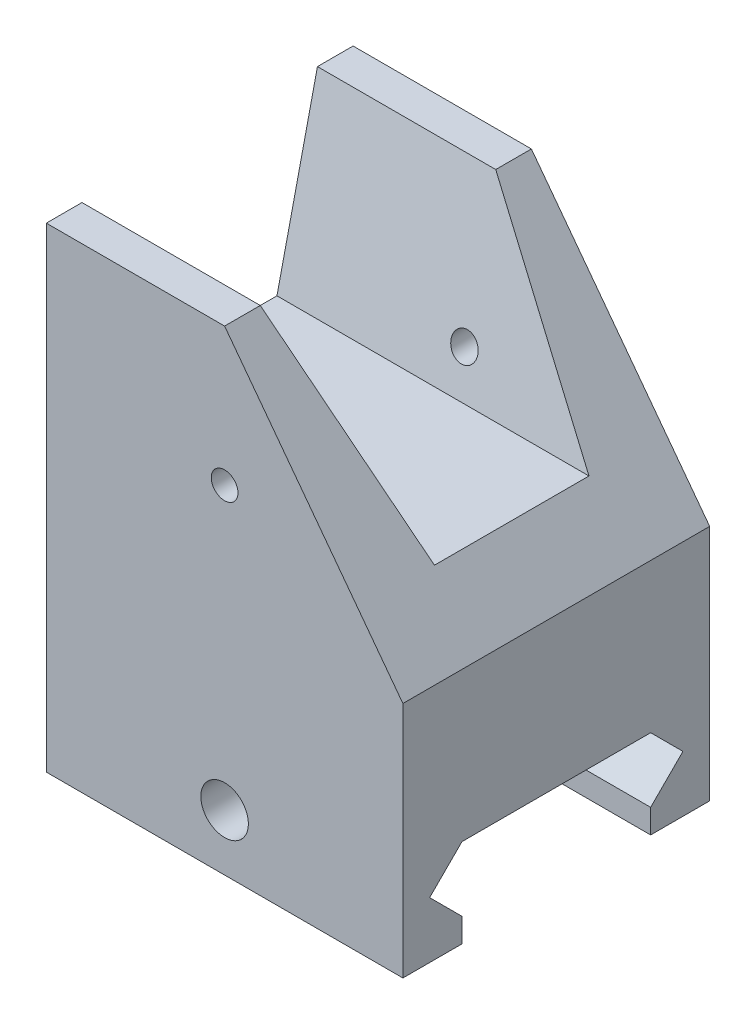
ISO-10303-21;
HEADER;
FILE_DESCRIPTION(('STEP AP214'),'2;1');
FILE_NAME('part.step','',(''),(''),'','','');
FILE_SCHEMA(('AUTOMOTIVE_DESIGN { 1 0 10303 214 1 1 1 1 }'));
ENDSEC;
DATA;
#1=APPLICATION_CONTEXT('core data for automotive mechanical design processes');
#2=APPLICATION_PROTOCOL_DEFINITION('international standard','automotive_design',2000,#1);
#3=PRODUCT_CONTEXT('',#1,'mechanical');
#4=PRODUCT('Part','Part','',(#3));
#5=PRODUCT_RELATED_PRODUCT_CATEGORY('part','',(#4));
#6=PRODUCT_DEFINITION_FORMATION('','',#4);
#7=PRODUCT_DEFINITION_CONTEXT('part definition',#1,'design');
#8=PRODUCT_DEFINITION('design','',#6,#7);
#9=PRODUCT_DEFINITION_SHAPE('','',#8);
#10=(LENGTH_UNIT() NAMED_UNIT(*) SI_UNIT(.MILLI.,.METRE.));
#11=(NAMED_UNIT(*) PLANE_ANGLE_UNIT() SI_UNIT($,.RADIAN.));
#12=(NAMED_UNIT(*) SI_UNIT($,.STERADIAN.) SOLID_ANGLE_UNIT());
#13=UNCERTAINTY_MEASURE_WITH_UNIT(LENGTH_MEASURE(1.E-05),#10,'distance_accuracy_value','');
#14=(GEOMETRIC_REPRESENTATION_CONTEXT(3) GLOBAL_UNCERTAINTY_ASSIGNED_CONTEXT((#13)) GLOBAL_UNIT_ASSIGNED_CONTEXT((#10,
#11,#12)) REPRESENTATION_CONTEXT('',''));
#15=CARTESIAN_POINT('',(0.,0.,0.));
#16=DIRECTION('',(0.,0.,1.));
#17=DIRECTION('',(1.,0.,0.));
#18=AXIS2_PLACEMENT_3D('',#15,#16,#17);
#19=CARTESIAN_POINT('',(0.,0.,12.905));
#20=DIRECTION('',(1.,0.,0.));
#21=DIRECTION('',(0.,1.,0.));
#22=AXIS2_PLACEMENT_3D('',#19,#20,#21);
#23=PLANE('',#22);
#24=DIRECTION('',(0.,-0.975190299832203,-0.22136819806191));
#25=VECTOR('',#24,1.);
#26=CARTESIAN_POINT('',(0.,25.,6.5));
#27=LINE('',#26,#25);
#28=CARTESIAN_POINT('',(0.,40.,9.905));
#29=VERTEX_POINT('',#28);
#30=CARTESIAN_POINT('',(0.,25.,6.5));
#31=VERTEX_POINT('',#30);
#32=EDGE_CURVE('E267',#29,#31,#27,.T.);
#33=ORIENTED_EDGE('',*,*,#32,.T.);
#34=DIRECTION('',(0.,0.,-1.));
#35=VECTOR('',#34,1.);
#36=CARTESIAN_POINT('',(0.,25.,-6.5));
#37=LINE('',#36,#35);
#38=CARTESIAN_POINT('',(0.,25.,-6.5));
#39=VERTEX_POINT('',#38);
#40=EDGE_CURVE('E270',#31,#39,#37,.T.);
#41=ORIENTED_EDGE('',*,*,#40,.T.);
#42=DIRECTION('',(0.,0.975190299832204,-0.22136819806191));
#43=VECTOR('',#42,1.);
#44=CARTESIAN_POINT('',(0.,40.,-9.905));
#45=LINE('',#44,#43);
#46=CARTESIAN_POINT('',(0.,40.,-9.905));
#47=VERTEX_POINT('',#46);
#48=EDGE_CURVE('E273',#39,#47,#45,.T.);
#49=ORIENTED_EDGE('',*,*,#48,.T.);
#50=DIRECTION('',(0.,0.,-1.));
#51=VECTOR('',#50,1.);
#52=CARTESIAN_POINT('',(-2.63677968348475E-13,40.,12.905));
#53=LINE('',#52,#51);
#54=CARTESIAN_POINT('',(-2.63677968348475E-13,40.,-12.905));
#55=VERTEX_POINT('',#54);
#56=EDGE_CURVE('E225',#47,#55,#53,.T.);
#57=ORIENTED_EDGE('',*,*,#56,.T.);
#58=DIRECTION('',(0.,-1.,0.));
#59=VECTOR('',#58,1.);
#60=CARTESIAN_POINT('',(0.,0.,-12.905));
#61=LINE('',#60,#59);
#62=CARTESIAN_POINT('',(0.,0.,-12.905));
#63=VERTEX_POINT('',#62);
#64=EDGE_CURVE('E213',#55,#63,#61,.T.);
#65=ORIENTED_EDGE('',*,*,#64,.T.);
#66=DIRECTION('',(0.,0.,-1.));
#67=VECTOR('',#66,1.);
#68=CARTESIAN_POINT('',(0.,0.,12.905));
#69=LINE('',#68,#67);
#70=CARTESIAN_POINT('',(0.,0.,-7.93719999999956));
#71=VERTEX_POINT('',#70);
#72=EDGE_CURVE('E221',#71,#63,#69,.T.);
#73=ORIENTED_EDGE('',*,*,#72,.F.);
#74=DIRECTION('',(0.,1.,0.));
#75=VECTOR('',#74,1.);
#76=CARTESIAN_POINT('',(0.,-2.71763942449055E-09,-7.93719999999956));
#77=LINE('',#76,#75);
#78=CARTESIAN_POINT('',(0.,2.01433522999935,-7.93719999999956));
#79=VERTEX_POINT('',#78);
#80=EDGE_CURVE('E288',#71,#79,#77,.T.);
#81=ORIENTED_EDGE('',*,*,#80,.T.);
#82=DIRECTION('',(0.,0.707106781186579,-0.707106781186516));
#83=VECTOR('',#82,1.);
#84=CARTESIAN_POINT('',(0.,2.01433522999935,-7.93719999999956));
#85=LINE('',#84,#83);
#86=CARTESIAN_POINT('',(0.,4.73213523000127,-10.6550000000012));
#87=VERTEX_POINT('',#86);
#88=EDGE_CURVE('E284',#79,#87,#85,.T.);
#89=ORIENTED_EDGE('',*,*,#88,.T.);
#90=DIRECTION('',(0.,0.707106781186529,0.707106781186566));
#91=VECTOR('',#90,1.);
#92=CARTESIAN_POINT('',(0.,4.73213523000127,-10.6550000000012));
#93=LINE('',#92,#91);
#94=CARTESIAN_POINT('',(0.,7.44993522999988,-7.9372000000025));
#95=VERTEX_POINT('',#94);
#96=EDGE_CURVE('E302',#87,#95,#93,.T.);
#97=ORIENTED_EDGE('',*,*,#96,.T.);
#98=DIRECTION('',(0.,0.,1.));
#99=VECTOR('',#98,1.);
#100=CARTESIAN_POINT('',(0.,7.44993522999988,-7.9372000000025));
#101=LINE('',#100,#99);
#102=CARTESIAN_POINT('',(0.,7.44993523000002,7.93780000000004));
#103=VERTEX_POINT('',#102);
#104=EDGE_CURVE('E305',#95,#103,#101,.T.);
#105=ORIENTED_EDGE('',*,*,#104,.T.);
#106=DIRECTION('',(0.,-0.707106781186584,0.707106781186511));
#107=VECTOR('',#106,1.);
#108=CARTESIAN_POINT('',(0.,7.44993523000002,7.93780000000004));
#109=LINE('',#108,#107);
#110=CARTESIAN_POINT('',(0.,4.73213522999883,10.655600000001));
#111=VERTEX_POINT('',#110);
#112=EDGE_CURVE('E308',#103,#111,#109,.T.);
#113=ORIENTED_EDGE('',*,*,#112,.T.);
#114=DIRECTION('',(0.,-0.707106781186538,-0.707106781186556));
#115=VECTOR('',#114,1.);
#116=CARTESIAN_POINT('',(0.,4.73213522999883,10.655600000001));
#117=LINE('',#116,#115);
#118=CARTESIAN_POINT('',(0.,2.01433522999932,7.93780000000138));
#119=VERTEX_POINT('',#118);
#120=EDGE_CURVE('E175',#111,#119,#117,.T.);
#121=ORIENTED_EDGE('',*,*,#120,.T.);
#122=DIRECTION('',(0.,-1.,0.));
#123=VECTOR('',#122,1.);
#124=CARTESIAN_POINT('',(0.,-1.38014109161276,7.93780000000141));
#125=LINE('',#124,#123);
#126=CARTESIAN_POINT('',(0.,0.,7.93780000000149));
#127=VERTEX_POINT('',#126);
#128=EDGE_CURVE('E311',#119,#127,#125,.T.);
#129=ORIENTED_EDGE('',*,*,#128,.T.);
#130=CARTESIAN_POINT('',(0.,0.,12.905));
#131=VERTEX_POINT('',#130);
#132=EDGE_CURVE('E222',#131,#127,#69,.T.);
#133=ORIENTED_EDGE('',*,*,#132,.F.);
#134=DIRECTION('',(0.,-1.,0.));
#135=VECTOR('',#134,1.);
#136=CARTESIAN_POINT('',(0.,0.,12.905));
#137=LINE('',#136,#135);
#138=CARTESIAN_POINT('',(-2.63677968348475E-13,40.,12.905));
#139=VERTEX_POINT('',#138);
#140=EDGE_CURVE('E200',#139,#131,#137,.T.);
#141=ORIENTED_EDGE('',*,*,#140,.F.);
#142=EDGE_CURVE('E226',#139,#29,#53,.T.);
#143=ORIENTED_EDGE('',*,*,#142,.T.);
#144=EDGE_LOOP('',(#33,#41,#49,#57,#65,#73,#81,#89,#97,#105,#113,#121,#129,#133,#141,#143));
#145=FACE_BOUND('',#144,.T.);
#146=ADVANCED_FACE('F32',(#145),#23,.F.);
#147=CARTESIAN_POINT('',(29.9999999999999,20.0000000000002,12.905));
#148=DIRECTION('',(-0.799999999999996,-0.600000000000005,0.));
#149=DIRECTION('',(0.600000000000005,-0.799999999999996,0.));
#150=AXIS2_PLACEMENT_3D('',#147,#148,#149);
#151=PLANE('',#150);
#152=DIRECTION('',(0.590344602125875,-0.787126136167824,-0.178677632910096));
#153=VECTOR('',#152,1.);
#154=CARTESIAN_POINT('',(29.2046704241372,21.0604394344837,5.6057197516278));
#155=LINE('',#154,#153);
#156=CARTESIAN_POINT('',(14.9999999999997,40.,9.905));
#157=VERTEX_POINT('',#156);
#158=CARTESIAN_POINT('',(26.2499999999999,25.,6.5));
#159=VERTEX_POINT('',#158);
#160=EDGE_CURVE('E282',#157,#159,#155,.T.);
#161=ORIENTED_EDGE('',*,*,#160,.F.);
#162=DIRECTION('',(0.,0.,-1.));
#163=VECTOR('',#162,1.);
#164=CARTESIAN_POINT('',(14.9999999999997,40.0000000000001,12.905));
#165=LINE('',#164,#163);
#166=CARTESIAN_POINT('',(14.9999999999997,40.0000000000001,12.905));
#167=VERTEX_POINT('',#166);
#168=EDGE_CURVE('E230',#167,#157,#165,.T.);
#169=ORIENTED_EDGE('',*,*,#168,.F.);
#170=DIRECTION('',(-0.600000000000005,0.799999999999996,0.));
#171=VECTOR('',#170,1.);
#172=CARTESIAN_POINT('',(29.9999999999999,20.0000000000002,12.905));
#173=LINE('',#172,#171);
#174=CARTESIAN_POINT('',(29.9999999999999,20.0000000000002,12.905));
#175=VERTEX_POINT('',#174);
#176=EDGE_CURVE('E195',#175,#167,#173,.T.);
#177=ORIENTED_EDGE('',*,*,#176,.F.);
#178=DIRECTION('',(0.,0.,-1.));
#179=VECTOR('',#178,1.);
#180=CARTESIAN_POINT('',(29.9999999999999,20.0000000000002,12.905));
#181=LINE('',#180,#179);
#182=CARTESIAN_POINT('',(29.9999999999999,20.0000000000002,-12.905));
#183=VERTEX_POINT('',#182);
#184=EDGE_CURVE('E233',#175,#183,#181,.T.);
#185=ORIENTED_EDGE('',*,*,#184,.T.);
#186=DIRECTION('',(-0.600000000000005,0.799999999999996,0.));
#187=VECTOR('',#186,1.);
#188=CARTESIAN_POINT('',(29.9999999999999,20.0000000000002,-12.905));
#189=LINE('',#188,#187);
#190=CARTESIAN_POINT('',(14.9999999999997,40.0000000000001,-12.905));
#191=VERTEX_POINT('',#190);
#192=EDGE_CURVE('E207',#183,#191,#189,.T.);
#193=ORIENTED_EDGE('',*,*,#192,.T.);
#194=CARTESIAN_POINT('',(14.9999999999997,40.0000000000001,-9.90500000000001));
#195=VERTEX_POINT('',#194);
#196=EDGE_CURVE('E229',#195,#191,#165,.T.);
#197=ORIENTED_EDGE('',*,*,#196,.F.);
#198=DIRECTION('',(-0.590344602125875,0.787126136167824,-0.178677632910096));
#199=VECTOR('',#198,1.);
#200=CARTESIAN_POINT('',(31.9271447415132,17.4304736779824,-4.78171752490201));
#201=LINE('',#200,#199);
#202=CARTESIAN_POINT('',(26.2499999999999,25.,-6.5));
#203=VERTEX_POINT('',#202);
#204=EDGE_CURVE('E280',#203,#195,#201,.T.);
#205=ORIENTED_EDGE('',*,*,#204,.F.);
#206=DIRECTION('',(0.,0.,-1.));
#207=VECTOR('',#206,1.);
#208=CARTESIAN_POINT('',(26.2499999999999,25.,12.905));
#209=LINE('',#208,#207);
#210=EDGE_CURVE('E40',#159,#203,#209,.T.);
#211=ORIENTED_EDGE('',*,*,#210,.F.);
#212=EDGE_LOOP('',(#161,#169,#177,#185,#193,#197,#205,#211));
#213=FACE_BOUND('',#212,.T.);
#214=ADVANCED_FACE('F362',(#213),#151,.F.);
#215=CARTESIAN_POINT('',(14.9999999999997,40.0000000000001,12.905));
#216=DIRECTION('',(0.,-1.,0.));
#217=DIRECTION('',(1.,0.,0.));
#218=AXIS2_PLACEMENT_3D('',#215,#216,#217);
#219=PLANE('',#218);
#220=DIRECTION('',(1.,0.,0.));
#221=VECTOR('',#220,1.);
#222=CARTESIAN_POINT('',(14.9999999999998,40.0000000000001,9.90500000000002));
#223=LINE('',#222,#221);
#224=EDGE_CURVE('E242',#29,#157,#223,.T.);
#225=ORIENTED_EDGE('',*,*,#224,.F.);
#226=ORIENTED_EDGE('',*,*,#142,.F.);
#227=DIRECTION('',(-1.,0.,0.));
#228=VECTOR('',#227,1.);
#229=CARTESIAN_POINT('',(14.9999999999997,40.0000000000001,12.905));
#230=LINE('',#229,#228);
#231=EDGE_CURVE('E198',#167,#139,#230,.T.);
#232=ORIENTED_EDGE('',*,*,#231,.F.);
#233=ORIENTED_EDGE('',*,*,#168,.T.);
#234=EDGE_LOOP('',(#225,#226,#232,#233));
#235=FACE_BOUND('',#234,.T.);
#236=ADVANCED_FACE('F395',(#235),#219,.F.);
#237=DIRECTION('',(-1.,0.,0.));
#238=VECTOR('',#237,1.);
#239=CARTESIAN_POINT('',(14.9999999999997,40.0000000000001,-9.90500000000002));
#240=LINE('',#239,#238);
#241=EDGE_CURVE('E240',#195,#47,#240,.T.);
#242=ORIENTED_EDGE('',*,*,#241,.F.);
#243=ORIENTED_EDGE('',*,*,#196,.T.);
#244=DIRECTION('',(-1.,0.,0.));
#245=VECTOR('',#244,1.);
#246=CARTESIAN_POINT('',(14.9999999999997,40.0000000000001,-12.905));
#247=LINE('',#246,#245);
#248=EDGE_CURVE('E210',#191,#55,#247,.T.);
#249=ORIENTED_EDGE('',*,*,#248,.T.);
#250=ORIENTED_EDGE('',*,*,#56,.F.);
#251=EDGE_LOOP('',(#242,#243,#249,#250));
#252=FACE_BOUND('',#251,.T.);
#253=ADVANCED_FACE('F399',(#252),#219,.F.);
#254=CARTESIAN_POINT('',(30.,2.0122792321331E-13,12.905));
#255=DIRECTION('',(-1.,0.,0.));
#256=DIRECTION('',(0.,-1.,0.));
#257=AXIS2_PLACEMENT_3D('',#254,#255,#256);
#258=PLANE('',#257);
#259=DIRECTION('',(0.,-1.,0.));
#260=VECTOR('',#259,1.);
#261=CARTESIAN_POINT('',(30.,2.01433522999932,7.93780000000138));
#262=LINE('',#261,#260);
#263=CARTESIAN_POINT('',(30.,2.01433522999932,7.93780000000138));
#264=VERTEX_POINT('',#263);
#265=CARTESIAN_POINT('',(30.,2.0122792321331E-13,7.93780000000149));
#266=VERTEX_POINT('',#265);
#267=EDGE_CURVE('E296',#264,#266,#262,.T.);
#268=ORIENTED_EDGE('',*,*,#267,.F.);
#269=DIRECTION('',(0.,-0.707106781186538,-0.707106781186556));
#270=VECTOR('',#269,1.);
#271=CARTESIAN_POINT('',(30.,4.73213522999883,10.655600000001));
#272=LINE('',#271,#270);
#273=CARTESIAN_POINT('',(30.,4.73213522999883,10.655600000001));
#274=VERTEX_POINT('',#273);
#275=EDGE_CURVE('E294',#274,#264,#272,.T.);
#276=ORIENTED_EDGE('',*,*,#275,.F.);
#277=DIRECTION('',(0.,-0.707106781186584,0.707106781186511));
#278=VECTOR('',#277,1.);
#279=CARTESIAN_POINT('',(30.,7.44993523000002,7.93780000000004));
#280=LINE('',#279,#278);
#281=CARTESIAN_POINT('',(30.,7.44993523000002,7.93780000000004));
#282=VERTEX_POINT('',#281);
#283=EDGE_CURVE('E292',#282,#274,#280,.T.);
#284=ORIENTED_EDGE('',*,*,#283,.F.);
#285=DIRECTION('',(0.,0.,1.));
#286=VECTOR('',#285,1.);
#287=CARTESIAN_POINT('',(30.,7.44993522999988,-7.9372000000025));
#288=LINE('',#287,#286);
#289=CARTESIAN_POINT('',(30.,7.44993522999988,-7.9372000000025));
#290=VERTEX_POINT('',#289);
#291=EDGE_CURVE('E290',#290,#282,#288,.T.);
#292=ORIENTED_EDGE('',*,*,#291,.F.);
#293=DIRECTION('',(0.,0.707106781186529,0.707106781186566));
#294=VECTOR('',#293,1.);
#295=CARTESIAN_POINT('',(30.,4.73213523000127,-10.6550000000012));
#296=LINE('',#295,#294);
#297=CARTESIAN_POINT('',(30.,4.73213523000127,-10.6550000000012));
#298=VERTEX_POINT('',#297);
#299=EDGE_CURVE('E287',#298,#290,#296,.T.);
#300=ORIENTED_EDGE('',*,*,#299,.F.);
#301=DIRECTION('',(0.,0.707106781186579,-0.707106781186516));
#302=VECTOR('',#301,1.);
#303=CARTESIAN_POINT('',(30.,2.01433522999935,-7.93719999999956));
#304=LINE('',#303,#302);
#305=CARTESIAN_POINT('',(30.,2.01433522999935,-7.93719999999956));
#306=VERTEX_POINT('',#305);
#307=EDGE_CURVE('E285',#306,#298,#304,.T.);
#308=ORIENTED_EDGE('',*,*,#307,.F.);
#309=DIRECTION('',(0.,1.,0.));
#310=VECTOR('',#309,1.);
#311=CARTESIAN_POINT('',(30.,-2.71763942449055E-09,-7.93719999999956));
#312=LINE('',#311,#310);
#313=CARTESIAN_POINT('',(30.,2.0122792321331E-13,-7.93719999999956));
#314=VERTEX_POINT('',#313);
#315=EDGE_CURVE('E298',#314,#306,#312,.T.);
#316=ORIENTED_EDGE('',*,*,#315,.F.);
#317=DIRECTION('',(0.,0.,-1.));
#318=VECTOR('',#317,1.);
#319=CARTESIAN_POINT('',(30.,2.0122792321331E-13,12.905));
#320=LINE('',#319,#318);
#321=CARTESIAN_POINT('',(30.,2.0122792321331E-13,-12.905));
#322=VERTEX_POINT('',#321);
#323=EDGE_CURVE('E204',#314,#322,#320,.T.);
#324=ORIENTED_EDGE('',*,*,#323,.T.);
#325=DIRECTION('',(0.,1.,0.));
#326=VECTOR('',#325,1.);
#327=CARTESIAN_POINT('',(30.,2.0122792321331E-13,-12.905));
#328=LINE('',#327,#326);
#329=EDGE_CURVE('E191',#322,#183,#328,.T.);
#330=ORIENTED_EDGE('',*,*,#329,.T.);
#331=ORIENTED_EDGE('',*,*,#184,.F.);
#332=DIRECTION('',(0.,1.,0.));
#333=VECTOR('',#332,1.);
#334=CARTESIAN_POINT('',(30.,2.0122792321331E-13,12.905));
#335=LINE('',#334,#333);
#336=CARTESIAN_POINT('',(30.,2.0122792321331E-13,12.905));
#337=VERTEX_POINT('',#336);
#338=EDGE_CURVE('E192',#337,#175,#335,.T.);
#339=ORIENTED_EDGE('',*,*,#338,.F.);
#340=EDGE_CURVE('E218',#337,#266,#320,.T.);
#341=ORIENTED_EDGE('',*,*,#340,.T.);
#342=EDGE_LOOP('',(#268,#276,#284,#292,#300,#308,#316,#324,#330,#331,#339,#341));
#343=FACE_BOUND('',#342,.T.);
#344=ADVANCED_FACE('F34',(#343),#258,.F.);
#345=CARTESIAN_POINT('',(30.,2.0122792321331E-13,12.905));
#346=DIRECTION('',(0.,1.,0.));
#347=DIRECTION('',(-1.,0.,0.));
#348=AXIS2_PLACEMENT_3D('',#345,#346,#347);
#349=PLANE('',#348);
#350=DIRECTION('',(-1.,0.,0.));
#351=VECTOR('',#350,1.);
#352=CARTESIAN_POINT('',(30.,2.0122792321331E-13,7.93780000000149));
#353=LINE('',#352,#351);
#354=EDGE_CURVE('E238',#266,#127,#353,.T.);
#355=ORIENTED_EDGE('',*,*,#354,.F.);
#356=ORIENTED_EDGE('',*,*,#340,.F.);
#357=DIRECTION('',(1.,0.,0.));
#358=VECTOR('',#357,1.);
#359=CARTESIAN_POINT('',(30.,2.0122792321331E-13,12.905));
#360=LINE('',#359,#358);
#361=EDGE_CURVE('E202',#131,#337,#360,.T.);
#362=ORIENTED_EDGE('',*,*,#361,.F.);
#363=ORIENTED_EDGE('',*,*,#132,.T.);
#364=EDGE_LOOP('',(#355,#356,#362,#363));
#365=FACE_BOUND('',#364,.T.);
#366=ADVANCED_FACE('F373',(#365),#349,.F.);
#367=DIRECTION('',(1.,0.,0.));
#368=VECTOR('',#367,1.);
#369=CARTESIAN_POINT('',(30.,2.0122792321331E-13,-7.93719999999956));
#370=LINE('',#369,#368);
#371=EDGE_CURVE('E236',#71,#314,#370,.T.);
#372=ORIENTED_EDGE('',*,*,#371,.F.);
#373=ORIENTED_EDGE('',*,*,#72,.T.);
#374=DIRECTION('',(1.,0.,0.));
#375=VECTOR('',#374,1.);
#376=CARTESIAN_POINT('',(30.,2.0122792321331E-13,-12.905));
#377=LINE('',#376,#375);
#378=EDGE_CURVE('E196',#63,#322,#377,.T.);
#379=ORIENTED_EDGE('',*,*,#378,.T.);
#380=ORIENTED_EDGE('',*,*,#323,.F.);
#381=EDGE_LOOP('',(#372,#373,#379,#380));
#382=FACE_BOUND('',#381,.T.);
#383=ADVANCED_FACE('F331',(#382),#349,.F.);
#384=CARTESIAN_POINT('',(0.,0.,12.905));
#385=DIRECTION('',(0.,0.,1.));
#386=DIRECTION('',(1.,0.,0.));
#387=AXIS2_PLACEMENT_3D('',#384,#385,#386);
#388=PLANE('',#387);
#389=CARTESIAN_POINT('',(15.,4.73213522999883,12.905));
#390=DIRECTION('',(0.,0.,1.));
#391=DIRECTION('',(1.,0.,0.));
#392=AXIS2_PLACEMENT_3D('',#389,#390,#391);
#393=CIRCLE('',#392,2.);
#394=CARTESIAN_POINT('',(17.,4.73213522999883,12.905));
#395=VERTEX_POINT('',#394);
#396=EDGE_CURVE('E247',#395,#395,#393,.T.);
#397=ORIENTED_EDGE('',*,*,#396,.F.);
#398=EDGE_LOOP('',(#397));
#399=FACE_BOUND('',#398,.T.);
#400=CARTESIAN_POINT('',(15.,28.399165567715,12.905));
#401=DIRECTION('',(0.,0.,1.));
#402=DIRECTION('',(1.,0.,0.));
#403=AXIS2_PLACEMENT_3D('',#400,#401,#402);
#404=CIRCLE('',#403,1.125);
#405=CARTESIAN_POINT('',(16.125,28.399165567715,12.905));
#406=VERTEX_POINT('',#405);
#407=EDGE_CURVE('E264',#406,#406,#404,.T.);
#408=ORIENTED_EDGE('',*,*,#407,.F.);
#409=EDGE_LOOP('',(#408));
#410=FACE_BOUND('',#409,.T.);
#411=ORIENTED_EDGE('',*,*,#338,.T.);
#412=ORIENTED_EDGE('',*,*,#176,.T.);
#413=ORIENTED_EDGE('',*,*,#231,.T.);
#414=ORIENTED_EDGE('',*,*,#140,.T.);
#415=ORIENTED_EDGE('',*,*,#361,.T.);
#416=EDGE_LOOP('',(#411,#412,#413,#414,#415));
#417=FACE_BOUND('',#416,.T.);
#418=ADVANCED_FACE('F353',(#399,#410,#417),#388,.T.);
#419=CARTESIAN_POINT('',(0.,0.,-12.905));
#420=DIRECTION('',(0.,0.,1.));
#421=DIRECTION('',(1.,0.,0.));
#422=AXIS2_PLACEMENT_3D('',#419,#420,#421);
#423=PLANE('',#422);
#424=CARTESIAN_POINT('',(15.,4.73213522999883,-12.905));
#425=DIRECTION('',(0.,0.,1.));
#426=DIRECTION('',(1.,0.,0.));
#427=AXIS2_PLACEMENT_3D('',#424,#425,#426);
#428=CIRCLE('',#427,2.);
#429=CARTESIAN_POINT('',(17.,4.73213522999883,-12.905));
#430=VERTEX_POINT('',#429);
#431=EDGE_CURVE('E254',#430,#430,#428,.T.);
#432=ORIENTED_EDGE('',*,*,#431,.T.);
#433=EDGE_LOOP('',(#432));
#434=FACE_BOUND('',#433,.T.);
#435=CARTESIAN_POINT('',(15.,28.399165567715,-12.905));
#436=DIRECTION('',(0.,0.,1.));
#437=DIRECTION('',(1.,0.,0.));
#438=AXIS2_PLACEMENT_3D('',#435,#436,#437);
#439=CIRCLE('',#438,1.125);
#440=CARTESIAN_POINT('',(16.125,28.399165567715,-12.905));
#441=VERTEX_POINT('',#440);
#442=EDGE_CURVE('E251',#441,#441,#439,.T.);
#443=ORIENTED_EDGE('',*,*,#442,.T.);
#444=EDGE_LOOP('',(#443));
#445=FACE_BOUND('',#444,.T.);
#446=ORIENTED_EDGE('',*,*,#329,.F.);
#447=ORIENTED_EDGE('',*,*,#378,.F.);
#448=ORIENTED_EDGE('',*,*,#64,.F.);
#449=ORIENTED_EDGE('',*,*,#248,.F.);
#450=ORIENTED_EDGE('',*,*,#192,.F.);
#451=EDGE_LOOP('',(#446,#447,#448,#449,#450));
#452=FACE_BOUND('',#451,.T.);
#453=ADVANCED_FACE('F349',(#434,#445,#452),#423,.F.);
#454=CARTESIAN_POINT('',(30.,-1.38014109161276,7.93780000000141));
#455=DIRECTION('',(0.,0.,-1.));
#456=DIRECTION('',(0.,1.,0.));
#457=AXIS2_PLACEMENT_3D('',#454,#455,#456);
#458=PLANE('',#457);
#459=ORIENTED_EDGE('',*,*,#354,.T.);
#460=ORIENTED_EDGE('',*,*,#128,.F.);
#461=DIRECTION('',(-1.,0.,0.));
#462=VECTOR('',#461,1.);
#463=CARTESIAN_POINT('',(30.,2.01433522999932,7.93780000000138));
#464=LINE('',#463,#462);
#465=EDGE_CURVE('E177',#264,#119,#464,.T.);
#466=ORIENTED_EDGE('',*,*,#465,.F.);
#467=ORIENTED_EDGE('',*,*,#267,.T.);
#468=EDGE_LOOP('',(#459,#460,#466,#467));
#469=FACE_BOUND('',#468,.T.);
#470=ADVANCED_FACE('F352',(#469),#458,.T.);
#471=CARTESIAN_POINT('',(30.,-2.71763942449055E-09,-7.93719999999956));
#472=DIRECTION('',(0.,0.,1.));
#473=DIRECTION('',(0.,-1.,0.));
#474=AXIS2_PLACEMENT_3D('',#471,#472,#473);
#475=PLANE('',#474);
#476=ORIENTED_EDGE('',*,*,#371,.T.);
#477=ORIENTED_EDGE('',*,*,#315,.T.);
#478=DIRECTION('',(-1.,0.,0.));
#479=VECTOR('',#478,1.);
#480=CARTESIAN_POINT('',(30.,2.01433522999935,-7.93719999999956));
#481=LINE('',#480,#479);
#482=EDGE_CURVE('E180',#306,#79,#481,.T.);
#483=ORIENTED_EDGE('',*,*,#482,.T.);
#484=ORIENTED_EDGE('',*,*,#80,.F.);
#485=EDGE_LOOP('',(#476,#477,#483,#484));
#486=FACE_BOUND('',#485,.T.);
#487=ADVANCED_FACE('F318',(#486),#475,.T.);
#488=CARTESIAN_POINT('',(30.,2.01433522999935,-7.93719999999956));
#489=DIRECTION('',(0.,0.707106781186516,0.707106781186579));
#490=DIRECTION('',(0.,-0.707106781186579,0.707106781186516));
#491=AXIS2_PLACEMENT_3D('',#488,#489,#490);
#492=PLANE('',#491);
#493=CARTESIAN_POINT('',(15.,4.73213522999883,-10.6549999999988));
#494=DIRECTION('',(0.,0.707106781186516,0.707106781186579));
#495=DIRECTION('',(0.,-0.707106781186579,0.707106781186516));
#496=AXIS2_PLACEMENT_3D('',#493,#494,#495);
#497=ELLIPSE('',#496,2.82842712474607,2.);
#498=CARTESIAN_POINT('',(13.,4.73213523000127,-10.6550000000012));
#499=VERTEX_POINT('',#498);
#500=CARTESIAN_POINT('',(17.,4.73213523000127,-10.6550000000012));
#501=VERTEX_POINT('',#500);
#502=EDGE_CURVE('E46',#499,#501,#497,.T.);
#503=ORIENTED_EDGE('',*,*,#502,.F.);
#504=DIRECTION('',(-1.,0.,0.));
#505=VECTOR('',#504,1.);
#506=CARTESIAN_POINT('',(30.,4.73213523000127,-10.6550000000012));
#507=LINE('',#506,#505);
#508=EDGE_CURVE('E187',#499,#87,#507,.T.);
#509=ORIENTED_EDGE('',*,*,#508,.T.);
#510=ORIENTED_EDGE('',*,*,#88,.F.);
#511=ORIENTED_EDGE('',*,*,#482,.F.);
#512=ORIENTED_EDGE('',*,*,#307,.T.);
#513=EDGE_CURVE('E188',#298,#501,#507,.T.);
#514=ORIENTED_EDGE('',*,*,#513,.T.);
#515=EDGE_LOOP('',(#503,#509,#510,#511,#512,#514));
#516=FACE_BOUND('',#515,.T.);
#517=ADVANCED_FACE('F323',(#516),#492,.T.);
#518=CARTESIAN_POINT('',(30.,4.73213523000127,-10.6550000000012));
#519=DIRECTION('',(0.,-0.707106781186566,0.70710678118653));
#520=DIRECTION('',(0.,-0.70710678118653,-0.707106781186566));
#521=AXIS2_PLACEMENT_3D('',#518,#519,#520);
#522=PLANE('',#521);
#523=CARTESIAN_POINT('',(15.,4.73213522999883,-10.6550000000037));
#524=DIRECTION('',(0.,-0.707106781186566,0.70710678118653));
#525=DIRECTION('',(0.,0.70710678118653,0.707106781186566));
#526=AXIS2_PLACEMENT_3D('',#523,#524,#525);
#527=ELLIPSE('',#526,2.82842712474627,2.);
#528=EDGE_CURVE('E170',#501,#499,#527,.T.);
#529=ORIENTED_EDGE('',*,*,#528,.F.);
#530=ORIENTED_EDGE('',*,*,#513,.F.);
#531=ORIENTED_EDGE('',*,*,#299,.T.);
#532=DIRECTION('',(-1.,0.,0.));
#533=VECTOR('',#532,1.);
#534=CARTESIAN_POINT('',(30.,7.44993522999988,-7.9372000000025));
#535=LINE('',#534,#533);
#536=EDGE_CURVE('E185',#290,#95,#535,.T.);
#537=ORIENTED_EDGE('',*,*,#536,.T.);
#538=ORIENTED_EDGE('',*,*,#96,.F.);
#539=ORIENTED_EDGE('',*,*,#508,.F.);
#540=EDGE_LOOP('',(#529,#530,#531,#537,#538,#539));
#541=FACE_BOUND('',#540,.T.);
#542=ADVANCED_FACE('F340',(#541),#522,.T.);
#543=CARTESIAN_POINT('',(30.,7.44993522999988,-7.9372000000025));
#544=DIRECTION('',(0.,-1.,0.));
#545=DIRECTION('',(0.,0.,-1.));
#546=AXIS2_PLACEMENT_3D('',#543,#544,#545);
#547=PLANE('',#546);
#548=ORIENTED_EDGE('',*,*,#104,.F.);
#549=ORIENTED_EDGE('',*,*,#536,.F.);
#550=ORIENTED_EDGE('',*,*,#291,.T.);
#551=DIRECTION('',(-1.,0.,0.));
#552=VECTOR('',#551,1.);
#553=CARTESIAN_POINT('',(30.,7.44993523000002,7.93780000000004));
#554=LINE('',#553,#552);
#555=EDGE_CURVE('E179',#282,#103,#554,.T.);
#556=ORIENTED_EDGE('',*,*,#555,.T.);
#557=EDGE_LOOP('',(#548,#549,#550,#556));
#558=FACE_BOUND('',#557,.T.);
#559=ADVANCED_FACE('F381',(#558),#547,.T.);
#560=CARTESIAN_POINT('',(30.,7.44993523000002,7.93780000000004));
#561=DIRECTION('',(0.,-0.707106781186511,-0.707106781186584));
#562=DIRECTION('',(0.,0.707106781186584,-0.707106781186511));
#563=AXIS2_PLACEMENT_3D('',#560,#561,#562);
#564=PLANE('',#563);
#565=CARTESIAN_POINT('',(15.,4.73213522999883,10.655600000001));
#566=DIRECTION('',(0.,-0.707106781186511,-0.707106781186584));
#567=DIRECTION('',(0.,-0.707106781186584,0.707106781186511));
#568=AXIS2_PLACEMENT_3D('',#565,#566,#567);
#569=ELLIPSE('',#568,2.82842712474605,2.);
#570=CARTESIAN_POINT('',(13.,4.73213522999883,10.655600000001));
#571=VERTEX_POINT('',#570);
#572=CARTESIAN_POINT('',(17.,4.73213522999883,10.655600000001));
#573=VERTEX_POINT('',#572);
#574=EDGE_CURVE('E52',#571,#573,#569,.T.);
#575=ORIENTED_EDGE('',*,*,#574,.F.);
#576=DIRECTION('',(-1.,0.,0.));
#577=VECTOR('',#576,1.);
#578=CARTESIAN_POINT('',(30.,4.73213522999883,10.655600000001));
#579=LINE('',#578,#577);
#580=EDGE_CURVE('E167',#571,#111,#579,.T.);
#581=ORIENTED_EDGE('',*,*,#580,.T.);
#582=ORIENTED_EDGE('',*,*,#112,.F.);
#583=ORIENTED_EDGE('',*,*,#555,.F.);
#584=ORIENTED_EDGE('',*,*,#283,.T.);
#585=EDGE_CURVE('E169',#274,#573,#579,.T.);
#586=ORIENTED_EDGE('',*,*,#585,.T.);
#587=EDGE_LOOP('',(#575,#581,#582,#583,#584,#586));
#588=FACE_BOUND('',#587,.T.);
#589=ADVANCED_FACE('F165',(#588),#564,.T.);
#590=CARTESIAN_POINT('',(30.,4.73213522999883,10.655600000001));
#591=DIRECTION('',(0.,0.707106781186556,-0.707106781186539));
#592=DIRECTION('',(0.,0.707106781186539,0.707106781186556));
#593=AXIS2_PLACEMENT_3D('',#590,#591,#592);
#594=PLANE('',#593);
#595=CARTESIAN_POINT('',(15.,4.73213522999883,10.655600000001));
#596=DIRECTION('',(0.,0.707106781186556,-0.707106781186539));
#597=DIRECTION('',(0.,0.707106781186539,0.707106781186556));
#598=AXIS2_PLACEMENT_3D('',#595,#596,#597);
#599=ELLIPSE('',#598,2.82842712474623,2.);
#600=EDGE_CURVE('E11',#573,#571,#599,.T.);
#601=ORIENTED_EDGE('',*,*,#600,.F.);
#602=ORIENTED_EDGE('',*,*,#585,.F.);
#603=ORIENTED_EDGE('',*,*,#275,.T.);
#604=ORIENTED_EDGE('',*,*,#465,.T.);
#605=ORIENTED_EDGE('',*,*,#120,.F.);
#606=ORIENTED_EDGE('',*,*,#580,.F.);
#607=EDGE_LOOP('',(#601,#602,#603,#604,#605,#606));
#608=FACE_BOUND('',#607,.T.);
#609=ADVANCED_FACE('F172',(#608),#594,.T.);
#610=CARTESIAN_POINT('',(30.,25.,-6.5));
#611=DIRECTION('',(0.,1.,0.));
#612=DIRECTION('',(0.,0.,1.));
#613=AXIS2_PLACEMENT_3D('',#610,#611,#612);
#614=PLANE('',#613);
#615=ORIENTED_EDGE('',*,*,#210,.T.);
#616=DIRECTION('',(-1.,0.,0.));
#617=VECTOR('',#616,1.);
#618=CARTESIAN_POINT('',(30.,25.,-6.5));
#619=LINE('',#618,#617);
#620=EDGE_CURVE('E276',#203,#39,#619,.T.);
#621=ORIENTED_EDGE('',*,*,#620,.T.);
#622=ORIENTED_EDGE('',*,*,#40,.F.);
#623=DIRECTION('',(-1.,0.,0.));
#624=VECTOR('',#623,1.);
#625=CARTESIAN_POINT('',(30.,25.,6.5));
#626=LINE('',#625,#624);
#627=EDGE_CURVE('E278',#159,#31,#626,.T.);
#628=ORIENTED_EDGE('',*,*,#627,.F.);
#629=EDGE_LOOP('',(#615,#621,#622,#628));
#630=FACE_BOUND('',#629,.T.);
#631=ADVANCED_FACE('F413',(#630),#614,.T.);
#632=CARTESIAN_POINT('',(30.,25.,6.5));
#633=DIRECTION('',(0.,0.22136819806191,-0.975190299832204));
#634=DIRECTION('',(0.,0.975190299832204,0.22136819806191));
#635=AXIS2_PLACEMENT_3D('',#632,#633,#634);
#636=PLANE('',#635);
#637=CARTESIAN_POINT('',(15.,28.399165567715,7.2716105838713));
#638=DIRECTION('',(0.,0.22136819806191,-0.975190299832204));
#639=DIRECTION('',(0.,0.975190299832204,0.22136819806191));
#640=AXIS2_PLACEMENT_3D('',#637,#638,#639);
#641=ELLIPSE('',#640,1.15362099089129,1.125);
#642=CARTESIAN_POINT('',(15.,29.524165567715,7.5269855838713));
#643=VERTEX_POINT('',#642);
#644=EDGE_CURVE('E246',#643,#643,#641,.T.);
#645=ORIENTED_EDGE('',*,*,#644,.F.);
#646=EDGE_LOOP('',(#645));
#647=FACE_BOUND('',#646,.T.);
#648=ORIENTED_EDGE('',*,*,#160,.T.);
#649=ORIENTED_EDGE('',*,*,#627,.T.);
#650=ORIENTED_EDGE('',*,*,#32,.F.);
#651=ORIENTED_EDGE('',*,*,#224,.T.);
#652=EDGE_LOOP('',(#648,#649,#650,#651));
#653=FACE_BOUND('',#652,.T.);
#654=ADVANCED_FACE('F409',(#647,#653),#636,.T.);
#655=CARTESIAN_POINT('',(30.,40.,-9.905));
#656=DIRECTION('',(0.,0.22136819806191,0.975190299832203));
#657=DIRECTION('',(0.,-0.975190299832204,0.22136819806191));
#658=AXIS2_PLACEMENT_3D('',#655,#656,#657);
#659=PLANE('',#658);
#660=CARTESIAN_POINT('',(15.,28.399165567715,-7.2716105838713));
#661=DIRECTION('',(0.,0.22136819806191,0.975190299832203));
#662=DIRECTION('',(0.,-0.975190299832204,0.22136819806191));
#663=AXIS2_PLACEMENT_3D('',#660,#661,#662);
#664=ELLIPSE('',#663,1.15362099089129,1.125);
#665=CARTESIAN_POINT('',(15.,27.274165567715,-7.0162355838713));
#666=VERTEX_POINT('',#665);
#667=EDGE_CURVE('E244',#666,#666,#664,.T.);
#668=ORIENTED_EDGE('',*,*,#667,.F.);
#669=EDGE_LOOP('',(#668));
#670=FACE_BOUND('',#669,.T.);
#671=ORIENTED_EDGE('',*,*,#204,.T.);
#672=ORIENTED_EDGE('',*,*,#241,.T.);
#673=ORIENTED_EDGE('',*,*,#48,.F.);
#674=ORIENTED_EDGE('',*,*,#620,.F.);
#675=EDGE_LOOP('',(#671,#672,#673,#674));
#676=FACE_BOUND('',#675,.T.);
#677=ADVANCED_FACE('F418',(#670,#676),#659,.T.);
#678=CARTESIAN_POINT('',(15.,28.399165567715,-13.));
#679=DIRECTION('',(0.,0.,1.));
#680=DIRECTION('',(1.,0.,0.));
#681=AXIS2_PLACEMENT_3D('',#678,#679,#680);
#682=CYLINDRICAL_SURFACE('',#681,1.125);
#683=ORIENTED_EDGE('',*,*,#667,.T.);
#684=EDGE_LOOP('',(#683));
#685=FACE_BOUND('',#684,.T.);
#686=ORIENTED_EDGE('',*,*,#442,.F.);
#687=EDGE_LOOP('',(#686));
#688=FACE_BOUND('',#687,.T.);
#689=ADVANCED_FACE('F422',(#685,#688),#682,.F.);
#690=ORIENTED_EDGE('',*,*,#407,.T.);
#691=EDGE_LOOP('',(#690));
#692=FACE_BOUND('',#691,.T.);
#693=ORIENTED_EDGE('',*,*,#644,.T.);
#694=EDGE_LOOP('',(#693));
#695=FACE_BOUND('',#694,.T.);
#696=ADVANCED_FACE('F429',(#692,#695),#682,.F.);
#697=CARTESIAN_POINT('',(15.,4.73213522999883,-13.));
#698=DIRECTION('',(0.,0.,1.));
#699=DIRECTION('',(1.,0.,0.));
#700=AXIS2_PLACEMENT_3D('',#697,#698,#699);
#701=CYLINDRICAL_SURFACE('',#700,2.);
#702=ORIENTED_EDGE('',*,*,#396,.T.);
#703=EDGE_LOOP('',(#702));
#704=FACE_BOUND('',#703,.T.);
#705=ORIENTED_EDGE('',*,*,#574,.T.);
#706=ORIENTED_EDGE('',*,*,#600,.T.);
#707=EDGE_LOOP('',(#705,#706));
#708=FACE_BOUND('',#707,.T.);
#709=ADVANCED_FACE('F159',(#704,#708),#701,.F.);
#710=ORIENTED_EDGE('',*,*,#502,.T.);
#711=ORIENTED_EDGE('',*,*,#528,.T.);
#712=EDGE_LOOP('',(#710,#711));
#713=FACE_BOUND('',#712,.T.);
#714=ORIENTED_EDGE('',*,*,#431,.F.);
#715=EDGE_LOOP('',(#714));
#716=FACE_BOUND('',#715,.T.);
#717=ADVANCED_FACE('F343',(#713,#716),#701,.F.);
#718=CLOSED_SHELL('',(#146,#214,#236,#253,#344,#366,#383,#418,#453,#470,#487,#517,#542,#559,
#589,#609,#631,#654,#677,#689,#696,#709,#717));
#719=MANIFOLD_SOLID_BREP('B2',#718);
#720=ADVANCED_BREP_SHAPE_REPRESENTATION('',(#18,#719),#14);
#721=SHAPE_DEFINITION_REPRESENTATION(#9,#720);
ENDSEC;
END-ISO-10303-21;
